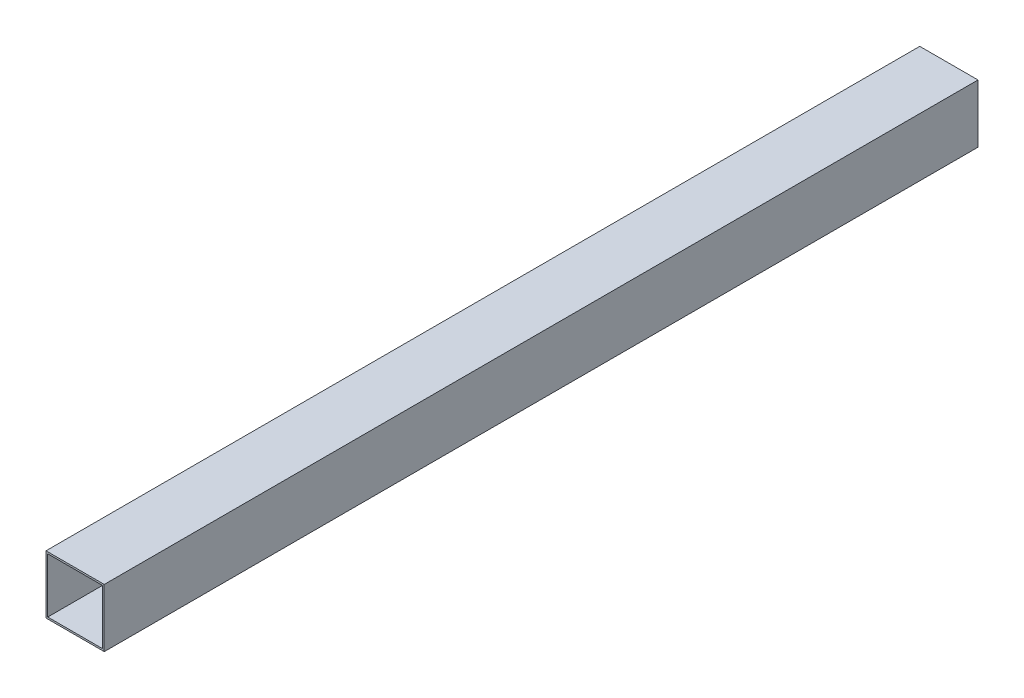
from build123d import *

# Parameters (mm, degrees)
SCHIZZO1_W                = 40
SCHIZZO1_H                = 40
SCHIZZO1_W_2              = 37.6
SCHIZZO1_H_2              = 37.6
ESTRUSIONE_SOTTILE1_DEPTH = 600


with BuildPart() as part:
    # Schizzo1 → Estrusione-Sottile1 (new body)
    with BuildSketch(Plane.XY):
        Rectangle(SCHIZZO1_W, SCHIZZO1_H)
        Rectangle(SCHIZZO1_W_2, SCHIZZO1_H_2, mode=Mode.SUBTRACT)
    extrude(amount=ESTRUSIONE_SOTTILE1_DEPTH)


solid = part.part
